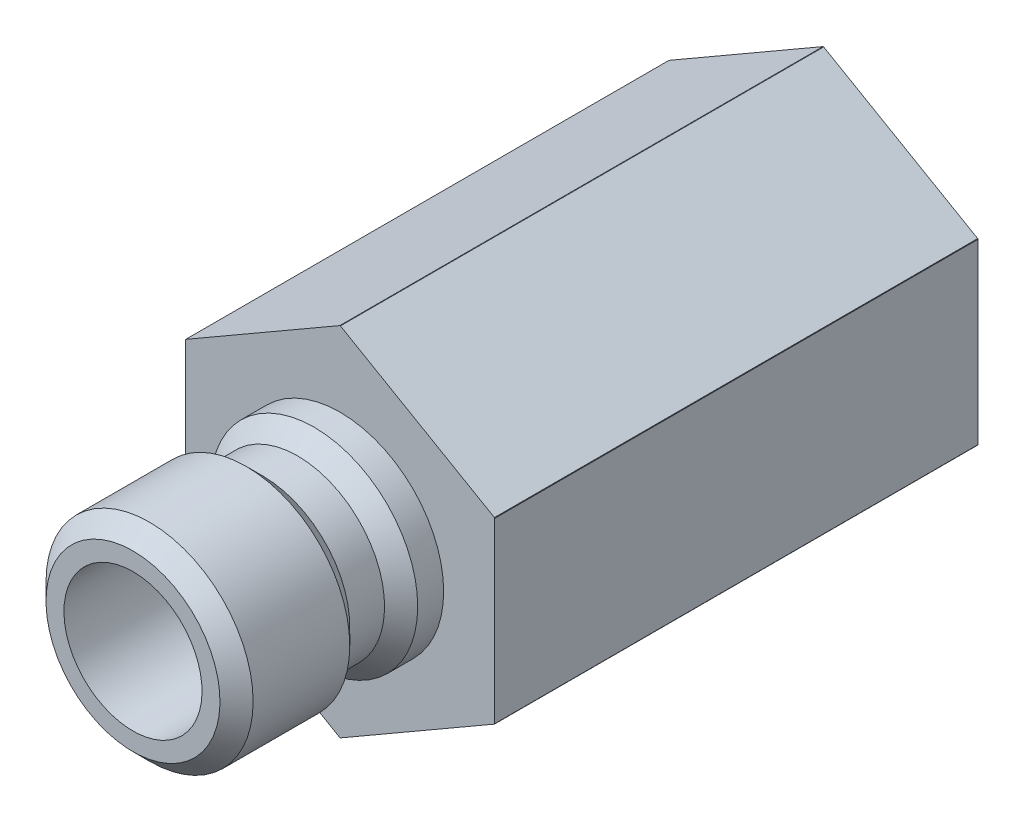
from build123d import *

# Parameters (mm, degrees)
SKETCH2_OUTSIDE_W  = 26.274
SKETCH2_OUTSIDE_H  = 26.274
CUT_EXTRUDE1_DEPTH = 26.071266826


with BuildPart() as part:
    # Sketch1 → Revolve1 (revolve)
    with BuildSketch(Plane(origin=(0, 0, 0), x_dir=(0, 0, -1), z_dir=(1, 0, 0))):
        Polygon((-9.525, 3.175), (-9.525, 4.0005), (-8.763, 4.7625), (-4.318, 4.7625), (-3.556, 4.0005), (-1.9558, 4.0005), (-1.1938, 4.7625), (0, 4.7625), (0, 8.2042), (22.225, 8.2042), (22.225, 5.938438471), (10.6045, 5.5753), (10.6045, 3.175), align=None)
    revolve(axis=Axis((0, 0, 0), (0, 0, 1)))

    # Sketch2 outside → Cut-Extrude1 (cut, through all)
    with BuildSketch(Plane.XY):
        Rectangle(SKETCH2_OUTSIDE_W, SKETCH2_OUTSIDE_H)
        Polygon((-7.112, 4.106115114), (-7.112, -4.106115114), (0, -8.212230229), (7.112, -4.106115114), (7.112, 4.106115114), (0, 8.212230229), align=None, mode=Mode.SUBTRACT)
    extrude(amount=-CUT_EXTRUDE1_DEPTH, mode=Mode.SUBTRACT)


solid = part.part
